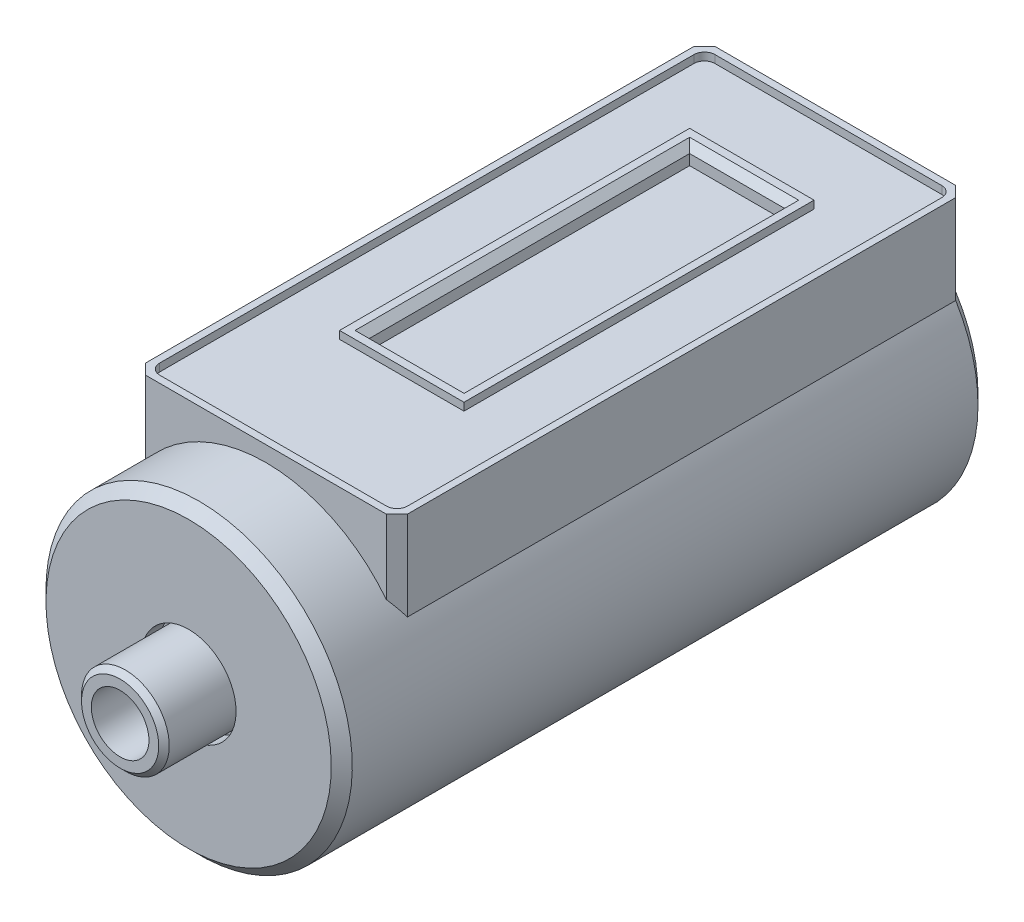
from build123d import *

# Parameters (mm, degrees)
EXTRUDE1_DEPTH     = 12.19
CHAMFER1_SIZE      = 0.76
SKETCH4_W          = 8.99
SKETCH4_H          = 25.3
CUT_EXTRUDE1_DEPTH = 0.56
SKETCH5_W          = 6.86
SKETCH5_H          = 23.16
CUT_EXTRUDE2_DEPTH = 1.27
CHAMFER2_SIZE      = 0.51
HOLE1_D            = 4.1656
HOLE1_DEPTH        = 6.35
HOLE1_TIP          = 1.251472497


with BuildPart() as part:
    # Sketch2 → Revolve1 (revolve)
    with BuildSketch(Plane(origin=(0, 0, 0), x_dir=(0, 0, -1), z_dir=(1, 0, 0))):
        Polygon((8.635, 0), (8.635, 2.79), (9.015, 3.17), (14.855, 3.17), (14.855, 3.43), (13.585, 3.43), (13.585, 10.31), (14.345, 11.07), (60.325, 11.07), (60.325, 0), align=None)
    revolve(axis=Axis((0, 0, -60.325), (0, 0, 1)))

    # Sketch3 → Extrude1 (add)
    with BuildSketch(Plane(origin=(0, 0, 0), x_dir=(1, 0, 0), z_dir=(0, 1, 0))):
        Polygon((-9.46, 60.325), (9.46, 60.325), (9.46, 19.935), (8.7, 19.175), (-8.7, 19.175), (-9.46, 19.935), align=None)
    extrude(amount=EXTRUDE1_DEPTH)

    # Chamfer1
    chamfer1_edges = [part.edges().sort_by_distance(p)[0] for p in [
        (0, -11.07, -60.325),
        (-9.46, 8.969599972, -60.325),
        (9.46, 8.969599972, -60.325),
    ]]
    chamfer(chamfer1_edges, length=CHAMFER1_SIZE)

    # Sketch4 → Cut-Extrude1 (cut)
    with BuildSketch(Plane(origin=(0, 12.19, 0), x_dir=(1, 0, 0), z_dir=(0, 1, 0))):
        with BuildLine():
            Line((-8.19, 59.815), (8.2, 59.815))
            ThreePointArc((8.2, 59.815), (8.737401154, 59.592401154), (8.96, 59.055))
            Line((8.96, 59.055), (8.96, 20.445))
            ThreePointArc((8.96, 20.445), (8.737401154, 19.907598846), (8.2, 19.685))
            Line((8.2, 19.685), (-8.19, 19.685))
            ThreePointArc((-8.19, 19.685), (-8.727401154, 19.907598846), (-8.95, 20.445))
            Line((-8.95, 20.445), (-8.95, 59.055))
            ThreePointArc((-8.95, 59.055), (-8.727401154, 59.592401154), (-8.19, 59.815))
        make_face()
        with Locations((0.005, 41.635)):
            Rectangle(SKETCH4_W, SKETCH4_H, mode=Mode.SUBTRACT)
    extrude(amount=-CUT_EXTRUDE1_DEPTH, mode=Mode.SUBTRACT)

    # Sketch5 → Cut-Extrude2 (cut)
    with BuildSketch(Plane(origin=(0, 12.19, 0), x_dir=(1, 0, 0), z_dir=(0, 1, 0))):
        with Locations((0.01, 41.635)):
            Rectangle(SKETCH5_W, SKETCH5_H)
    extrude(amount=-CUT_EXTRUDE2_DEPTH, mode=Mode.SUBTRACT)

    # Chamfer2
    chamfer2_edges = [part.edges().sort_by_distance(p)[0] for p in [
        (-3.42, 12.19, -41.635),
        (0.01, 12.19, -30.055),
        (3.44, 12.19, -41.635),
        (0.01, 12.19, -53.215),
    ]]
    chamfer(chamfer2_edges, length=CHAMFER2_SIZE)

    # Hole1
    with Locations(Plane.XY.offset(-8.635)):
        with Locations((0, 0)):
            Hole(HOLE1_D / 2, depth=HOLE1_DEPTH)
            with Locations((0, 0, -(HOLE1_DEPTH + HOLE1_TIP / 2))):  # 118° drill point
                Cone(0, HOLE1_D / 2, HOLE1_TIP, mode=Mode.SUBTRACT)


solid = part.part
